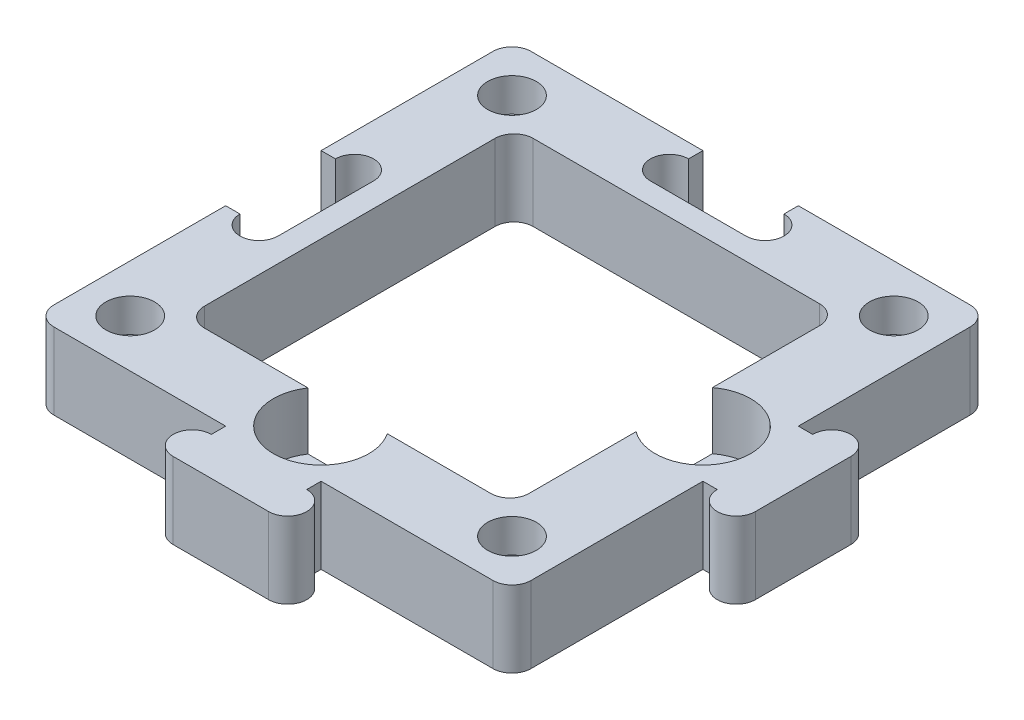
from build123d import *

# Parameters (mm, degrees)
SKETCH2_R           = 2.55
BOSS_EXTRUDE2_DEPTH = 8
SKETCH3_R           = 5
CUT_EXTRUDE1_DEPTH  = 6
SKETCH5_R           = 3
BOSS_EXTRUDE3_DEPTH = 4.5


with BuildPart() as part:
    # Sketch2 → Boss-Extrude2 (new body)
    # profile 1 of 3: a face of its own
    with BuildSketch(Plane(origin=(0, 0, 0), x_dir=(1, 0, 0), z_dir=(0, 1, 0))):
        with BuildLine():
            Line((-25, 5), (-23.5, 5))
            ThreePointArc((-23.5, 5), (-21.5, 7), (-19.5, 5))
            Line((-19.5, 5), (-19.5, -5))
            ThreePointArc((-19.5, -5), (-21.5, -7), (-23.5, -5))
            Line((-23.5, -5), (-25, -5))
            Line((-25, -5), (-25, -23))
            ThreePointArc((-25, -23), (-24.414213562, -24.414213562), (-23, -25))
            Line((-23, -25), (23, -25))
            ThreePointArc((23, -25), (24.414213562, -24.414213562), (25, -23))
            Line((25, -23), (25, 23))
            ThreePointArc((25, 23), (24.414213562, 24.414213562), (23, 25))
            Line((23, 25), (5, 25))
            Line((5, 25), (5, 23.5))
            ThreePointArc((5, 23.5), (7, 21.5), (5, 19.5))
            Line((5, 19.5), (-5, 19.5))
            ThreePointArc((-5, 19.5), (-7, 21.5), (-5, 23.5))
            Line((-5, 23.5), (-5, 25))
            Line((-5, 25), (-23, 25))
            ThreePointArc((-23, 25), (-24.414213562, 24.414213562), (-25, 23))
            Line((-25, 23), (-25, 5))
        make_face()
        with Locations(Location((20, -20, 0), (0, 0, 270))):
            Circle(SKETCH2_R, mode=Mode.SUBTRACT)
        with Locations(Location((20, 20, 0), (0, 0, 270))):
            Circle(SKETCH2_R, mode=Mode.SUBTRACT)
        with Locations(Location((-20, 20, 0), (0, 0, 270))):
            Circle(SKETCH2_R, mode=Mode.SUBTRACT)
        with Locations(Location((-20, -20, 0), (0, 0, 270))):
            Circle(SKETCH2_R, mode=Mode.SUBTRACT)
        with BuildLine():
            ThreePointArc((17, -1.25), (23.25, 0), (17, 1.25))
            Line((17, 1.25), (17, 15.217914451))
            ThreePointArc((17, 15.217914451), (16.414213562, 16.632128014), (15, 17.217914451))
            Line((15, 17.217914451), (-15, 17.217914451))
            ThreePointArc((-15, 17.217914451), (-16.414213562, 16.632128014), (-17, 15.217914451))
            Line((-17, 15.217914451), (-17, -15.217914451))
            ThreePointArc((-17, -15.217914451), (-16.414213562, -16.632128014), (-15, -17.217914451))
            Line((-15, -17.217914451), (-1.25, -17.217914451))
            ThreePointArc((-1.25, -17.217914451), (0, -23.05), (1.25, -17.217914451))
            Line((1.25, -17.217914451), (15, -17.217914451))
            ThreePointArc((15, -17.217914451), (16.414213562, -16.632128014), (17, -15.217914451))
            Line((17, -15.217914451), (17, -1.25))
        make_face(mode=Mode.SUBTRACT)
    # profile 2 of 3: a face of its own
    with BuildSketch(Plane(origin=(0, 0, 0), x_dir=(1, 0, 0), z_dir=(0, 1, 0))):
        with BuildLine():
            Line((5, -26.5), (5, -25))
            Line((5, -25), (-5, -25))
            Line((-5, -25), (-5, -26.5))
            ThreePointArc((-5, -26.5), (-7, -28.5), (-5, -30.5))
            Line((-5, -30.5), (5, -30.5))
            ThreePointArc((5, -30.5), (7, -28.5), (5, -26.5))
        make_face()
    # profile 3 of 3: a face of its own
    with BuildSketch(Plane(origin=(0, 0, 0), x_dir=(1, 0, 0), z_dir=(0, 1, 0))):
        with BuildLine():
            Line((25, 5), (25, -5))
            Line((25, -5), (26.5, -5))
            ThreePointArc((26.5, -5), (28.5, -7), (30.5, -5))
            Line((30.5, -5), (30.5, 5))
            ThreePointArc((30.5, 5), (28.5, 7), (26.5, 5))
            Line((26.5, 5), (25, 5))
        make_face()
    extrude(amount=BOSS_EXTRUDE2_DEPTH)

    # Sketch3 → Cut-Extrude1 (cut)
    with BuildSketch(Plane(origin=(0, 8, 0), x_dir=(1, 0, 0), z_dir=(0, 1, 0))):
        with Locations((0, -20)):
            Circle(SKETCH3_R)
        with Locations((20, 0)):
            Circle(SKETCH3_R)
    extrude(amount=-CUT_EXTRUDE1_DEPTH, mode=Mode.SUBTRACT)

    # Sketch5 → Boss-Extrude3 (add)
    with BuildSketch(Plane.XZ):
        with Locations((-20, 20)):
            Circle(SKETCH5_R)
        with Locations((20, 20)):
            Circle(SKETCH5_R)
        with Locations((20, -20)):
            Circle(SKETCH5_R)
        with Locations((-20, -20)):
            Circle(SKETCH5_R)
    extrude(amount=-BOSS_EXTRUDE3_DEPTH)


solid = part.part
